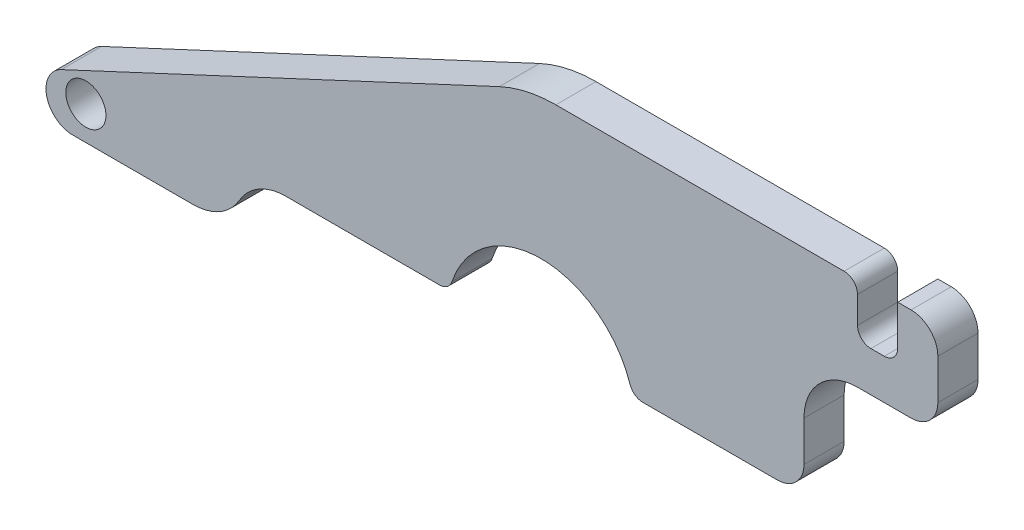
ISO-10303-21;
HEADER;
FILE_DESCRIPTION(('STEP AP214'),'2;1');
FILE_NAME('part.step','',(''),(''),'','','');
FILE_SCHEMA(('AUTOMOTIVE_DESIGN { 1 0 10303 214 1 1 1 1 }'));
ENDSEC;
DATA;
#1=APPLICATION_CONTEXT('core data for automotive mechanical design processes');
#2=APPLICATION_PROTOCOL_DEFINITION('international standard','automotive_design',2000,#1);
#3=PRODUCT_CONTEXT('',#1,'mechanical');
#4=PRODUCT('Part','Part','',(#3));
#5=PRODUCT_RELATED_PRODUCT_CATEGORY('part','',(#4));
#6=PRODUCT_DEFINITION_FORMATION('','',#4);
#7=PRODUCT_DEFINITION_CONTEXT('part definition',#1,'design');
#8=PRODUCT_DEFINITION('design','',#6,#7);
#9=PRODUCT_DEFINITION_SHAPE('','',#8);
#10=(LENGTH_UNIT() NAMED_UNIT(*) SI_UNIT(.MILLI.,.METRE.));
#11=(NAMED_UNIT(*) PLANE_ANGLE_UNIT() SI_UNIT($,.RADIAN.));
#12=(NAMED_UNIT(*) SI_UNIT($,.STERADIAN.) SOLID_ANGLE_UNIT());
#13=UNCERTAINTY_MEASURE_WITH_UNIT(LENGTH_MEASURE(1.E-05),#10,'distance_accuracy_value','');
#14=(GEOMETRIC_REPRESENTATION_CONTEXT(3) GLOBAL_UNCERTAINTY_ASSIGNED_CONTEXT((#13)) GLOBAL_UNIT_ASSIGNED_CONTEXT((#10,
#11,#12)) REPRESENTATION_CONTEXT('',''));
#15=CARTESIAN_POINT('',(0.,0.,0.));
#16=DIRECTION('',(0.,0.,1.));
#17=DIRECTION('',(1.,0.,0.));
#18=AXIS2_PLACEMENT_3D('',#15,#16,#17);
#19=CARTESIAN_POINT('',(5.82006920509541,12.5625,1.5));
#20=DIRECTION('',(0.,0.,-1.));
#21=DIRECTION('',(-1.,0.,0.));
#22=AXIS2_PLACEMENT_3D('',#19,#20,#21);
#23=PLANE('',#22);
#24=DIRECTION('',(-1.,0.,0.));
#25=VECTOR('',#24,1.);
#26=CARTESIAN_POINT('',(5.32006920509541,13.5625,1.5));
#27=LINE('',#26,#25);
#28=CARTESIAN_POINT('',(5.8200692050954,13.5625,1.5));
#29=VERTEX_POINT('',#28);
#30=CARTESIAN_POINT('',(5.32006920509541,13.5625,1.5));
#31=VERTEX_POINT('',#30);
#32=EDGE_CURVE('E290',#29,#31,#27,.T.);
#33=ORIENTED_EDGE('',*,*,#32,.T.);
#34=DIRECTION('',(0.,-1.,0.));
#35=VECTOR('',#34,1.);
#36=CARTESIAN_POINT('',(5.32006920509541,12.0625,1.5));
#37=LINE('',#36,#35);
#38=CARTESIAN_POINT('',(5.32006920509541,12.0625,1.5));
#39=VERTEX_POINT('',#38);
#40=EDGE_CURVE('E147',#31,#39,#37,.T.);
#41=ORIENTED_EDGE('',*,*,#40,.T.);
#42=CARTESIAN_POINT('',(4.82006920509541,12.0625,1.5));
#43=DIRECTION('',(0.,0.,-1.));
#44=DIRECTION('',(1.,0.,0.));
#45=AXIS2_PLACEMENT_3D('',#42,#43,#44);
#46=CIRCLE('',#45,0.5);
#47=CARTESIAN_POINT('',(4.8200692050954,11.5625,1.5));
#48=VERTEX_POINT('',#47);
#49=EDGE_CURVE('E359',#39,#48,#46,.T.);
#50=ORIENTED_EDGE('',*,*,#49,.T.);
#51=DIRECTION('',(-1.,0.,0.));
#52=VECTOR('',#51,1.);
#53=CARTESIAN_POINT('',(4.32006920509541,11.5625,1.5));
#54=LINE('',#53,#52);
#55=CARTESIAN_POINT('',(4.32006920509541,11.5625,1.5));
#56=VERTEX_POINT('',#55);
#57=EDGE_CURVE('E378',#48,#56,#54,.T.);
#58=ORIENTED_EDGE('',*,*,#57,.T.);
#59=CARTESIAN_POINT('',(4.32006920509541,12.0625,1.5));
#60=DIRECTION('',(0.,0.,-1.));
#61=DIRECTION('',(1.,0.,0.));
#62=AXIS2_PLACEMENT_3D('',#59,#60,#61);
#63=CIRCLE('',#62,0.5);
#64=CARTESIAN_POINT('',(3.82006920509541,12.0625,1.5));
#65=VERTEX_POINT('',#64);
#66=EDGE_CURVE('E375',#56,#65,#63,.T.);
#67=ORIENTED_EDGE('',*,*,#66,.T.);
#68=DIRECTION('',(0.,1.,0.));
#69=VECTOR('',#68,1.);
#70=CARTESIAN_POINT('',(3.82006920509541,13.0625,1.5));
#71=LINE('',#70,#69);
#72=CARTESIAN_POINT('',(3.82006920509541,13.0625,1.5));
#73=VERTEX_POINT('',#72);
#74=EDGE_CURVE('E377',#65,#73,#71,.T.);
#75=ORIENTED_EDGE('',*,*,#74,.T.);
#76=CARTESIAN_POINT('',(3.32006920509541,13.0625,1.5));
#77=DIRECTION('',(0.,0.,1.));
#78=DIRECTION('',(-1.,0.,0.));
#79=AXIS2_PLACEMENT_3D('',#76,#77,#78);
#80=CIRCLE('',#79,0.5);
#81=CARTESIAN_POINT('',(3.3200692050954,13.5625,1.5));
#82=VERTEX_POINT('',#81);
#83=EDGE_CURVE('E380',#73,#82,#80,.T.);
#84=ORIENTED_EDGE('',*,*,#83,.T.);
#85=DIRECTION('',(-1.,0.,0.));
#86=VECTOR('',#85,1.);
#87=CARTESIAN_POINT('',(-7.44645748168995,13.5625,1.5));
#88=LINE('',#87,#86);
#89=CARTESIAN_POINT('',(-7.44645748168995,13.5625,1.5));
#90=VERTEX_POINT('',#89);
#91=EDGE_CURVE('E386',#82,#90,#88,.T.);
#92=ORIENTED_EDGE('',*,*,#91,.T.);
#93=CARTESIAN_POINT('',(-7.44645748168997,8.56250000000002,1.5));
#94=DIRECTION('',(0.,0.,1.));
#95=DIRECTION('',(-1.,0.,0.));
#96=AXIS2_PLACEMENT_3D('',#93,#94,#95);
#97=CIRCLE('',#96,5.);
#98=CARTESIAN_POINT('',(-9.55954879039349,13.0940389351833,1.5));
#99=VERTEX_POINT('',#98);
#100=EDGE_CURVE('E388',#90,#99,#97,.T.);
#101=ORIENTED_EDGE('',*,*,#100,.T.);
#102=DIRECTION('',(-0.906307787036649,-0.422618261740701,0.));
#103=VECTOR('',#102,1.);
#104=CARTESIAN_POINT('',(-25.9119097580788,5.4688077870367,1.5));
#105=LINE('',#104,#103);
#106=CARTESIAN_POINT('',(-25.9119097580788,5.4688077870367,1.5));
#107=VERTEX_POINT('',#106);
#108=EDGE_CURVE('E390',#99,#107,#105,.T.);
#109=ORIENTED_EDGE('',*,*,#108,.T.);
#110=CARTESIAN_POINT('',(-25.4892914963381,4.56250000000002,1.5));
#111=DIRECTION('',(0.,0.,1.));
#112=DIRECTION('',(1.,0.,0.));
#113=AXIS2_PLACEMENT_3D('',#110,#111,#112);
#114=CIRCLE('',#113,1.);
#115=CARTESIAN_POINT('',(-25.4892914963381,3.56250000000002,1.5));
#116=VERTEX_POINT('',#115);
#117=EDGE_CURVE('E392',#107,#116,#114,.T.);
#118=ORIENTED_EDGE('',*,*,#117,.T.);
#119=DIRECTION('',(1.,0.,0.));
#120=VECTOR('',#119,1.);
#121=CARTESIAN_POINT('',(-25.4892914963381,3.56250000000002,1.5));
#122=LINE('',#121,#120);
#123=CARTESIAN_POINT('',(-21.0000000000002,3.56250000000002,1.5));
#124=VERTEX_POINT('',#123);
#125=EDGE_CURVE('E394',#116,#124,#122,.T.);
#126=ORIENTED_EDGE('',*,*,#125,.T.);
#127=CARTESIAN_POINT('',(-21.0000000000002,5.56250000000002,1.5));
#128=DIRECTION('',(0.,0.,1.));
#129=DIRECTION('',(1.,0.,0.));
#130=AXIS2_PLACEMENT_3D('',#127,#128,#129);
#131=CIRCLE('',#130,2.);
#132=CARTESIAN_POINT('',(-19.2679491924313,4.56250000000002,1.5));
#133=VERTEX_POINT('',#132);
#134=EDGE_CURVE('E396',#124,#133,#131,.T.);
#135=ORIENTED_EDGE('',*,*,#134,.T.);
#136=CARTESIAN_POINT('',(-17.5358983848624,3.56250000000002,1.5));
#137=DIRECTION('',(0.,0.,-1.));
#138=DIRECTION('',(1.,0.,0.));
#139=AXIS2_PLACEMENT_3D('',#136,#137,#138);
#140=CIRCLE('',#139,2.);
#141=CARTESIAN_POINT('',(-17.5358983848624,5.56250000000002,1.5));
#142=VERTEX_POINT('',#141);
#143=EDGE_CURVE('E398',#133,#142,#140,.T.);
#144=ORIENTED_EDGE('',*,*,#143,.T.);
#145=DIRECTION('',(1.,0.,0.));
#146=VECTOR('',#145,1.);
#147=CARTESIAN_POINT('',(-11.7996710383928,5.56250000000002,1.5));
#148=LINE('',#147,#146);
#149=CARTESIAN_POINT('',(-11.7996710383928,5.56250000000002,1.5));
#150=VERTEX_POINT('',#149);
#151=EDGE_CURVE('E400',#142,#150,#148,.T.);
#152=ORIENTED_EDGE('',*,*,#151,.T.);
#153=CARTESIAN_POINT('',(-11.7996710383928,6.06250000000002,1.5));
#154=DIRECTION('',(0.,0.,1.));
#155=DIRECTION('',(-1.,0.,0.));
#156=AXIS2_PLACEMENT_3D('',#153,#154,#155);
#157=CIRCLE('',#156,0.5);
#158=CARTESIAN_POINT('',(-11.3247121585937,5.90625000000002,1.5));
#159=VERTEX_POINT('',#158);
#160=EDGE_CURVE('E402',#150,#159,#157,.T.);
#161=ORIENTED_EDGE('',*,*,#160,.T.);
#162=CARTESIAN_POINT('',(-8.00000000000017,4.81250000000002,1.5));
#163=DIRECTION('',(0.,0.,-1.));
#164=DIRECTION('',(-1.,0.,0.));
#165=AXIS2_PLACEMENT_3D('',#162,#163,#164);
#166=CIRCLE('',#165,3.5);
#167=CARTESIAN_POINT('',(-4.67528784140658,5.90625000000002,1.5));
#168=VERTEX_POINT('',#167);
#169=EDGE_CURVE('E404',#159,#168,#166,.T.);
#170=ORIENTED_EDGE('',*,*,#169,.T.);
#171=CARTESIAN_POINT('',(-4.2003289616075,6.06250000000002,1.5));
#172=DIRECTION('',(0.,0.,1.));
#173=DIRECTION('',(-1.,0.,0.));
#174=AXIS2_PLACEMENT_3D('',#171,#172,#173);
#175=CIRCLE('',#174,0.499999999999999);
#176=CARTESIAN_POINT('',(-4.2003289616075,5.56250000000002,1.5));
#177=VERTEX_POINT('',#176);
#178=EDGE_CURVE('E406',#168,#177,#175,.T.);
#179=ORIENTED_EDGE('',*,*,#178,.T.);
#180=DIRECTION('',(1.,0.,0.));
#181=VECTOR('',#180,1.);
#182=CARTESIAN_POINT('',(0.820069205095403,5.56250000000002,1.5));
#183=LINE('',#182,#181);
#184=CARTESIAN_POINT('',(0.820069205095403,5.56250000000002,1.5));
#185=VERTEX_POINT('',#184);
#186=EDGE_CURVE('E408',#177,#185,#183,.T.);
#187=ORIENTED_EDGE('',*,*,#186,.T.);
#188=CARTESIAN_POINT('',(0.820069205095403,6.56250000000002,1.5));
#189=DIRECTION('',(0.,0.,1.));
#190=DIRECTION('',(-1.,0.,0.));
#191=AXIS2_PLACEMENT_3D('',#188,#189,#190);
#192=CIRCLE('',#191,1.);
#193=CARTESIAN_POINT('',(1.8200692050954,6.56250000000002,1.5));
#194=VERTEX_POINT('',#193);
#195=EDGE_CURVE('E410',#185,#194,#192,.T.);
#196=ORIENTED_EDGE('',*,*,#195,.T.);
#197=DIRECTION('',(0.,1.,0.));
#198=VECTOR('',#197,1.);
#199=CARTESIAN_POINT('',(1.82006920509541,8.0625,1.5));
#200=LINE('',#199,#198);
#201=CARTESIAN_POINT('',(1.82006920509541,8.0625,1.5));
#202=VERTEX_POINT('',#201);
#203=EDGE_CURVE('E412',#194,#202,#200,.T.);
#204=ORIENTED_EDGE('',*,*,#203,.T.);
#205=CARTESIAN_POINT('',(3.82006920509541,8.06250000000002,1.5));
#206=DIRECTION('',(0.,0.,-1.));
#207=DIRECTION('',(1.,0.,0.));
#208=AXIS2_PLACEMENT_3D('',#205,#206,#207);
#209=CIRCLE('',#208,2.);
#210=CARTESIAN_POINT('',(3.82006920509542,10.0625,1.5));
#211=VERTEX_POINT('',#210);
#212=EDGE_CURVE('E414',#202,#211,#209,.T.);
#213=ORIENTED_EDGE('',*,*,#212,.T.);
#214=DIRECTION('',(1.,0.,0.));
#215=VECTOR('',#214,1.);
#216=CARTESIAN_POINT('',(4.0075692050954,10.0625,1.5));
#217=LINE('',#216,#215);
#218=CARTESIAN_POINT('',(5.8200692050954,10.0625,1.5));
#219=VERTEX_POINT('',#218);
#220=EDGE_CURVE('E220',#211,#219,#217,.T.);
#221=ORIENTED_EDGE('',*,*,#220,.T.);
#222=CARTESIAN_POINT('',(5.82006920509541,11.0625,1.5));
#223=DIRECTION('',(0.,0.,1.));
#224=DIRECTION('',(-1.,0.,0.));
#225=AXIS2_PLACEMENT_3D('',#222,#223,#224);
#226=CIRCLE('',#225,1.);
#227=CARTESIAN_POINT('',(6.82006920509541,11.0625,1.5));
#228=VERTEX_POINT('',#227);
#229=EDGE_CURVE('E214',#219,#228,#226,.T.);
#230=ORIENTED_EDGE('',*,*,#229,.T.);
#231=DIRECTION('',(0.,1.,0.));
#232=VECTOR('',#231,1.);
#233=CARTESIAN_POINT('',(6.82006920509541,12.5625,1.5));
#234=LINE('',#233,#232);
#235=CARTESIAN_POINT('',(6.82006920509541,12.5625,1.5));
#236=VERTEX_POINT('',#235);
#237=EDGE_CURVE('E218',#228,#236,#234,.T.);
#238=ORIENTED_EDGE('',*,*,#237,.T.);
#239=CARTESIAN_POINT('',(5.82006920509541,12.5625,1.5));
#240=DIRECTION('',(0.,0.,1.));
#241=DIRECTION('',(-1.,0.,0.));
#242=AXIS2_PLACEMENT_3D('',#239,#240,#241);
#243=CIRCLE('',#242,1.);
#244=EDGE_CURVE('E50',#236,#29,#243,.T.);
#245=ORIENTED_EDGE('',*,*,#244,.T.);
#246=EDGE_LOOP('',(#33,#41,#50,#58,#67,#75,#84,#92,#101,#109,#118,#126,#135,#144,#152,#161,#170,
#179,#187,#196,#204,#213,#221,#230,#238,#245));
#247=FACE_BOUND('',#246,.T.);
#248=CARTESIAN_POINT('',(-25.0000000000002,4.81250000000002,1.5));
#249=DIRECTION('',(0.,0.,1.));
#250=DIRECTION('',(1.,0.,0.));
#251=AXIS2_PLACEMENT_3D('',#248,#249,#250);
#252=CIRCLE('',#251,0.750000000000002);
#253=CARTESIAN_POINT('',(-24.2500000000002,4.81250000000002,1.5));
#254=VERTEX_POINT('',#253);
#255=EDGE_CURVE('E242',#254,#254,#252,.T.);
#256=ORIENTED_EDGE('',*,*,#255,.F.);
#257=EDGE_LOOP('',(#256));
#258=FACE_BOUND('',#257,.T.);
#259=ADVANCED_FACE('F33',(#247,#258),#23,.F.);
#260=CARTESIAN_POINT('',(5.82006920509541,12.5625,0.));
#261=DIRECTION('',(0.,0.,-1.));
#262=DIRECTION('',(-1.,0.,0.));
#263=AXIS2_PLACEMENT_3D('',#260,#261,#262);
#264=PLANE('',#263);
#265=DIRECTION('',(-1.,0.,0.));
#266=VECTOR('',#265,1.);
#267=CARTESIAN_POINT('',(5.32006920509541,13.5625,0.));
#268=LINE('',#267,#266);
#269=CARTESIAN_POINT('',(5.8200692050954,13.5625,0.));
#270=VERTEX_POINT('',#269);
#271=CARTESIAN_POINT('',(5.32006920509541,13.5625,0.));
#272=VERTEX_POINT('',#271);
#273=EDGE_CURVE('E238',#270,#272,#268,.T.);
#274=ORIENTED_EDGE('',*,*,#273,.F.);
#275=CARTESIAN_POINT('',(5.82006920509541,12.5625,0.));
#276=DIRECTION('',(0.,0.,1.));
#277=DIRECTION('',(-1.,0.,0.));
#278=AXIS2_PLACEMENT_3D('',#275,#276,#277);
#279=CIRCLE('',#278,1.);
#280=CARTESIAN_POINT('',(6.82006920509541,12.5625,0.));
#281=VERTEX_POINT('',#280);
#282=EDGE_CURVE('E139',#281,#270,#279,.T.);
#283=ORIENTED_EDGE('',*,*,#282,.F.);
#284=DIRECTION('',(0.,1.,0.));
#285=VECTOR('',#284,1.);
#286=CARTESIAN_POINT('',(6.82006920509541,12.5625,0.));
#287=LINE('',#286,#285);
#288=CARTESIAN_POINT('',(6.82006920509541,11.0625,0.));
#289=VERTEX_POINT('',#288);
#290=EDGE_CURVE('E133',#289,#281,#287,.T.);
#291=ORIENTED_EDGE('',*,*,#290,.F.);
#292=CARTESIAN_POINT('',(5.82006920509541,11.0625,0.));
#293=DIRECTION('',(0.,0.,1.));
#294=DIRECTION('',(-1.,0.,0.));
#295=AXIS2_PLACEMENT_3D('',#292,#293,#294);
#296=CIRCLE('',#295,1.);
#297=CARTESIAN_POINT('',(5.8200692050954,10.0625,0.));
#298=VERTEX_POINT('',#297);
#299=EDGE_CURVE('E228',#298,#289,#296,.T.);
#300=ORIENTED_EDGE('',*,*,#299,.F.);
#301=DIRECTION('',(1.,0.,0.));
#302=VECTOR('',#301,1.);
#303=CARTESIAN_POINT('',(5.8200692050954,10.0625,0.));
#304=LINE('',#303,#302);
#305=CARTESIAN_POINT('',(3.82006920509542,10.0625,0.));
#306=VERTEX_POINT('',#305);
#307=EDGE_CURVE('E285',#306,#298,#304,.T.);
#308=ORIENTED_EDGE('',*,*,#307,.F.);
#309=CARTESIAN_POINT('',(3.82006920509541,8.06250000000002,0.));
#310=DIRECTION('',(0.,0.,-1.));
#311=DIRECTION('',(1.,0.,0.));
#312=AXIS2_PLACEMENT_3D('',#309,#310,#311);
#313=CIRCLE('',#312,2.);
#314=CARTESIAN_POINT('',(1.82006920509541,8.0625,0.));
#315=VERTEX_POINT('',#314);
#316=EDGE_CURVE('E282',#315,#306,#313,.T.);
#317=ORIENTED_EDGE('',*,*,#316,.F.);
#318=DIRECTION('',(0.,1.,0.));
#319=VECTOR('',#318,1.);
#320=CARTESIAN_POINT('',(1.82006920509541,8.0625,0.));
#321=LINE('',#320,#319);
#322=CARTESIAN_POINT('',(1.8200692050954,6.56250000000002,0.));
#323=VERTEX_POINT('',#322);
#324=EDGE_CURVE('E280',#323,#315,#321,.T.);
#325=ORIENTED_EDGE('',*,*,#324,.F.);
#326=CARTESIAN_POINT('',(0.820069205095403,6.56250000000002,0.));
#327=DIRECTION('',(0.,0.,1.));
#328=DIRECTION('',(-1.,0.,0.));
#329=AXIS2_PLACEMENT_3D('',#326,#327,#328);
#330=CIRCLE('',#329,1.);
#331=CARTESIAN_POINT('',(0.820069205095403,5.56250000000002,0.));
#332=VERTEX_POINT('',#331);
#333=EDGE_CURVE('E278',#332,#323,#330,.T.);
#334=ORIENTED_EDGE('',*,*,#333,.F.);
#335=DIRECTION('',(1.,0.,0.));
#336=VECTOR('',#335,1.);
#337=CARTESIAN_POINT('',(0.820069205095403,5.56250000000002,0.));
#338=LINE('',#337,#336);
#339=CARTESIAN_POINT('',(-4.2003289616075,5.56250000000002,0.));
#340=VERTEX_POINT('',#339);
#341=EDGE_CURVE('E276',#340,#332,#338,.T.);
#342=ORIENTED_EDGE('',*,*,#341,.F.);
#343=CARTESIAN_POINT('',(-4.2003289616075,6.06250000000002,0.));
#344=DIRECTION('',(0.,0.,1.));
#345=DIRECTION('',(-1.,0.,0.));
#346=AXIS2_PLACEMENT_3D('',#343,#344,#345);
#347=CIRCLE('',#346,0.499999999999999);
#348=CARTESIAN_POINT('',(-4.67528784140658,5.90625000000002,0.));
#349=VERTEX_POINT('',#348);
#350=EDGE_CURVE('E274',#349,#340,#347,.T.);
#351=ORIENTED_EDGE('',*,*,#350,.F.);
#352=CARTESIAN_POINT('',(-8.00000000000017,4.81250000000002,0.));
#353=DIRECTION('',(0.,0.,-1.));
#354=DIRECTION('',(-1.,0.,0.));
#355=AXIS2_PLACEMENT_3D('',#352,#353,#354);
#356=CIRCLE('',#355,3.5);
#357=CARTESIAN_POINT('',(-11.3247121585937,5.90625000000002,0.));
#358=VERTEX_POINT('',#357);
#359=EDGE_CURVE('E272',#358,#349,#356,.T.);
#360=ORIENTED_EDGE('',*,*,#359,.F.);
#361=CARTESIAN_POINT('',(-11.7996710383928,6.06250000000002,0.));
#362=DIRECTION('',(0.,0.,1.));
#363=DIRECTION('',(-1.,0.,0.));
#364=AXIS2_PLACEMENT_3D('',#361,#362,#363);
#365=CIRCLE('',#364,0.5);
#366=CARTESIAN_POINT('',(-11.7996710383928,5.56250000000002,0.));
#367=VERTEX_POINT('',#366);
#368=EDGE_CURVE('E270',#367,#358,#365,.T.);
#369=ORIENTED_EDGE('',*,*,#368,.F.);
#370=DIRECTION('',(1.,0.,0.));
#371=VECTOR('',#370,1.);
#372=CARTESIAN_POINT('',(-11.7996710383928,5.56250000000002,0.));
#373=LINE('',#372,#371);
#374=CARTESIAN_POINT('',(-17.5358983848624,5.56250000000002,0.));
#375=VERTEX_POINT('',#374);
#376=EDGE_CURVE('E268',#375,#367,#373,.T.);
#377=ORIENTED_EDGE('',*,*,#376,.F.);
#378=CARTESIAN_POINT('',(-17.5358983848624,3.56250000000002,0.));
#379=DIRECTION('',(0.,0.,-1.));
#380=DIRECTION('',(1.,0.,0.));
#381=AXIS2_PLACEMENT_3D('',#378,#379,#380);
#382=CIRCLE('',#381,2.);
#383=CARTESIAN_POINT('',(-19.2679491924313,4.56250000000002,0.));
#384=VERTEX_POINT('',#383);
#385=EDGE_CURVE('E266',#384,#375,#382,.T.);
#386=ORIENTED_EDGE('',*,*,#385,.F.);
#387=CARTESIAN_POINT('',(-21.0000000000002,5.56250000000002,0.));
#388=DIRECTION('',(0.,0.,1.));
#389=DIRECTION('',(1.,0.,0.));
#390=AXIS2_PLACEMENT_3D('',#387,#388,#389);
#391=CIRCLE('',#390,2.);
#392=CARTESIAN_POINT('',(-21.0000000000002,3.56250000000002,0.));
#393=VERTEX_POINT('',#392);
#394=EDGE_CURVE('E264',#393,#384,#391,.T.);
#395=ORIENTED_EDGE('',*,*,#394,.F.);
#396=DIRECTION('',(1.,0.,0.));
#397=VECTOR('',#396,1.);
#398=CARTESIAN_POINT('',(-25.4892914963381,3.56250000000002,0.));
#399=LINE('',#398,#397);
#400=CARTESIAN_POINT('',(-25.4892914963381,3.56250000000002,0.));
#401=VERTEX_POINT('',#400);
#402=EDGE_CURVE('E262',#401,#393,#399,.T.);
#403=ORIENTED_EDGE('',*,*,#402,.F.);
#404=CARTESIAN_POINT('',(-25.4892914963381,4.56250000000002,0.));
#405=DIRECTION('',(0.,0.,1.));
#406=DIRECTION('',(1.,0.,0.));
#407=AXIS2_PLACEMENT_3D('',#404,#405,#406);
#408=CIRCLE('',#407,1.);
#409=CARTESIAN_POINT('',(-25.9119097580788,5.4688077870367,0.));
#410=VERTEX_POINT('',#409);
#411=EDGE_CURVE('E260',#410,#401,#408,.T.);
#412=ORIENTED_EDGE('',*,*,#411,.F.);
#413=DIRECTION('',(-0.906307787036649,-0.422618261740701,0.));
#414=VECTOR('',#413,1.);
#415=CARTESIAN_POINT('',(-25.9119097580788,5.4688077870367,0.));
#416=LINE('',#415,#414);
#417=CARTESIAN_POINT('',(-9.55954879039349,13.0940389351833,0.));
#418=VERTEX_POINT('',#417);
#419=EDGE_CURVE('E258',#418,#410,#416,.T.);
#420=ORIENTED_EDGE('',*,*,#419,.F.);
#421=CARTESIAN_POINT('',(-7.44645748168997,8.56250000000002,0.));
#422=DIRECTION('',(0.,0.,1.));
#423=DIRECTION('',(-1.,0.,0.));
#424=AXIS2_PLACEMENT_3D('',#421,#422,#423);
#425=CIRCLE('',#424,5.);
#426=CARTESIAN_POINT('',(-7.44645748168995,13.5625,0.));
#427=VERTEX_POINT('',#426);
#428=EDGE_CURVE('E256',#427,#418,#425,.T.);
#429=ORIENTED_EDGE('',*,*,#428,.F.);
#430=DIRECTION('',(-1.,0.,0.));
#431=VECTOR('',#430,1.);
#432=CARTESIAN_POINT('',(-7.44645748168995,13.5625,0.));
#433=LINE('',#432,#431);
#434=CARTESIAN_POINT('',(3.3200692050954,13.5625,0.));
#435=VERTEX_POINT('',#434);
#436=EDGE_CURVE('E254',#435,#427,#433,.T.);
#437=ORIENTED_EDGE('',*,*,#436,.F.);
#438=CARTESIAN_POINT('',(3.32006920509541,13.0625,0.));
#439=DIRECTION('',(0.,0.,1.));
#440=DIRECTION('',(-1.,0.,0.));
#441=AXIS2_PLACEMENT_3D('',#438,#439,#440);
#442=CIRCLE('',#441,0.5);
#443=CARTESIAN_POINT('',(3.82006920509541,13.0625,0.));
#444=VERTEX_POINT('',#443);
#445=EDGE_CURVE('E252',#444,#435,#442,.T.);
#446=ORIENTED_EDGE('',*,*,#445,.F.);
#447=DIRECTION('',(0.,1.,0.));
#448=VECTOR('',#447,1.);
#449=CARTESIAN_POINT('',(3.82006920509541,13.0625,0.));
#450=LINE('',#449,#448);
#451=CARTESIAN_POINT('',(3.82006920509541,12.0625,0.));
#452=VERTEX_POINT('',#451);
#453=EDGE_CURVE('E250',#452,#444,#450,.T.);
#454=ORIENTED_EDGE('',*,*,#453,.F.);
#455=CARTESIAN_POINT('',(4.32006920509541,12.0625,0.));
#456=DIRECTION('',(0.,0.,-1.));
#457=DIRECTION('',(1.,0.,0.));
#458=AXIS2_PLACEMENT_3D('',#455,#456,#457);
#459=CIRCLE('',#458,0.5);
#460=CARTESIAN_POINT('',(4.32006920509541,11.5625,0.));
#461=VERTEX_POINT('',#460);
#462=EDGE_CURVE('E248',#461,#452,#459,.T.);
#463=ORIENTED_EDGE('',*,*,#462,.F.);
#464=DIRECTION('',(-1.,0.,0.));
#465=VECTOR('',#464,1.);
#466=CARTESIAN_POINT('',(4.32006920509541,11.5625,0.));
#467=LINE('',#466,#465);
#468=CARTESIAN_POINT('',(4.8200692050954,11.5625,0.));
#469=VERTEX_POINT('',#468);
#470=EDGE_CURVE('E246',#469,#461,#467,.T.);
#471=ORIENTED_EDGE('',*,*,#470,.F.);
#472=CARTESIAN_POINT('',(4.82006920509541,12.0625,0.));
#473=DIRECTION('',(0.,0.,-1.));
#474=DIRECTION('',(1.,0.,0.));
#475=AXIS2_PLACEMENT_3D('',#472,#473,#474);
#476=CIRCLE('',#475,0.5);
#477=CARTESIAN_POINT('',(5.32006920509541,12.0625,0.));
#478=VERTEX_POINT('',#477);
#479=EDGE_CURVE('E244',#478,#469,#476,.T.);
#480=ORIENTED_EDGE('',*,*,#479,.F.);
#481=DIRECTION('',(0.,-1.,0.));
#482=VECTOR('',#481,1.);
#483=CARTESIAN_POINT('',(5.32006920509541,12.0625,0.));
#484=LINE('',#483,#482);
#485=EDGE_CURVE('E241',#272,#478,#484,.T.);
#486=ORIENTED_EDGE('',*,*,#485,.F.);
#487=EDGE_LOOP('',(#274,#283,#291,#300,#308,#317,#325,#334,#342,#351,#360,#369,#377,#386,#395,
#403,#412,#420,#429,#437,#446,#454,#463,#471,#480,#486));
#488=FACE_BOUND('',#487,.T.);
#489=CARTESIAN_POINT('',(-25.0000000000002,4.81250000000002,0.));
#490=DIRECTION('',(0.,0.,1.));
#491=DIRECTION('',(1.,0.,0.));
#492=AXIS2_PLACEMENT_3D('',#489,#490,#491);
#493=CIRCLE('',#492,0.750000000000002);
#494=CARTESIAN_POINT('',(-24.2500000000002,4.81250000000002,0.));
#495=VERTEX_POINT('',#494);
#496=EDGE_CURVE('E745',#495,#495,#493,.T.);
#497=ORIENTED_EDGE('',*,*,#496,.T.);
#498=EDGE_LOOP('',(#497));
#499=FACE_BOUND('',#498,.T.);
#500=ADVANCED_FACE('F363',(#488,#499),#264,.T.);
#501=CARTESIAN_POINT('',(5.32006920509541,13.5625,1.5));
#502=DIRECTION('',(0.,-1.,0.));
#503=DIRECTION('',(0.,0.,-1.));
#504=AXIS2_PLACEMENT_3D('',#501,#502,#503);
#505=PLANE('',#504);
#506=ORIENTED_EDGE('',*,*,#273,.T.);
#507=DIRECTION('',(0.,0.,-1.));
#508=VECTOR('',#507,1.);
#509=CARTESIAN_POINT('',(5.32006920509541,13.5625,1.5));
#510=LINE('',#509,#508);
#511=EDGE_CURVE('E11',#31,#272,#510,.T.);
#512=ORIENTED_EDGE('',*,*,#511,.F.);
#513=ORIENTED_EDGE('',*,*,#32,.F.);
#514=DIRECTION('',(0.,0.,-1.));
#515=VECTOR('',#514,1.);
#516=CARTESIAN_POINT('',(5.8200692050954,13.5625,1.5));
#517=LINE('',#516,#515);
#518=EDGE_CURVE('E234',#29,#270,#517,.T.);
#519=ORIENTED_EDGE('',*,*,#518,.T.);
#520=EDGE_LOOP('',(#506,#512,#513,#519));
#521=FACE_BOUND('',#520,.T.);
#522=ADVANCED_FACE('F35',(#521),#505,.F.);
#523=CARTESIAN_POINT('',(5.32006920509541,12.0625,1.5));
#524=DIRECTION('',(1.,0.,0.));
#525=DIRECTION('',(0.,0.,-1.));
#526=AXIS2_PLACEMENT_3D('',#523,#524,#525);
#527=PLANE('',#526);
#528=ORIENTED_EDGE('',*,*,#485,.T.);
#529=DIRECTION('',(0.,0.,-1.));
#530=VECTOR('',#529,1.);
#531=CARTESIAN_POINT('',(5.32006920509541,12.0625,1.5));
#532=LINE('',#531,#530);
#533=EDGE_CURVE('E42',#39,#478,#532,.T.);
#534=ORIENTED_EDGE('',*,*,#533,.F.);
#535=ORIENTED_EDGE('',*,*,#40,.F.);
#536=ORIENTED_EDGE('',*,*,#511,.T.);
#537=EDGE_LOOP('',(#528,#534,#535,#536));
#538=FACE_BOUND('',#537,.T.);
#539=ADVANCED_FACE('F447',(#538),#527,.F.);
#540=CARTESIAN_POINT('',(4.82006920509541,12.0625,1.5));
#541=DIRECTION('',(0.,0.,-1.));
#542=DIRECTION('',(-1.,0.,0.));
#543=AXIS2_PLACEMENT_3D('',#540,#541,#542);
#544=CYLINDRICAL_SURFACE('',#543,0.5);
#545=ORIENTED_EDGE('',*,*,#479,.T.);
#546=DIRECTION('',(0.,0.,-1.));
#547=VECTOR('',#546,1.);
#548=CARTESIAN_POINT('',(4.8200692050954,11.5625,1.5));
#549=LINE('',#548,#547);
#550=EDGE_CURVE('E351',#48,#469,#549,.T.);
#551=ORIENTED_EDGE('',*,*,#550,.F.);
#552=ORIENTED_EDGE('',*,*,#49,.F.);
#553=ORIENTED_EDGE('',*,*,#533,.T.);
#554=EDGE_LOOP('',(#545,#551,#552,#553));
#555=FACE_BOUND('',#554,.T.);
#556=ADVANCED_FACE('F357',(#555),#544,.F.);
#557=CARTESIAN_POINT('',(4.32006920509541,11.5625,1.5));
#558=DIRECTION('',(0.,-1.,0.));
#559=DIRECTION('',(0.,0.,-1.));
#560=AXIS2_PLACEMENT_3D('',#557,#558,#559);
#561=PLANE('',#560);
#562=ORIENTED_EDGE('',*,*,#470,.T.);
#563=DIRECTION('',(0.,0.,-1.));
#564=VECTOR('',#563,1.);
#565=CARTESIAN_POINT('',(4.32006920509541,11.5625,1.5));
#566=LINE('',#565,#564);
#567=EDGE_CURVE('E348',#56,#461,#566,.T.);
#568=ORIENTED_EDGE('',*,*,#567,.F.);
#569=ORIENTED_EDGE('',*,*,#57,.F.);
#570=ORIENTED_EDGE('',*,*,#550,.T.);
#571=EDGE_LOOP('',(#562,#568,#569,#570));
#572=FACE_BOUND('',#571,.T.);
#573=ADVANCED_FACE('F369',(#572),#561,.F.);
#574=CARTESIAN_POINT('',(4.32006920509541,12.0625,1.5));
#575=DIRECTION('',(0.,0.,-1.));
#576=DIRECTION('',(-1.,0.,0.));
#577=AXIS2_PLACEMENT_3D('',#574,#575,#576);
#578=CYLINDRICAL_SURFACE('',#577,0.5);
#579=ORIENTED_EDGE('',*,*,#462,.T.);
#580=DIRECTION('',(0.,0.,-1.));
#581=VECTOR('',#580,1.);
#582=CARTESIAN_POINT('',(3.82006920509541,12.0625,1.5));
#583=LINE('',#582,#581);
#584=EDGE_CURVE('E345',#65,#452,#583,.T.);
#585=ORIENTED_EDGE('',*,*,#584,.F.);
#586=ORIENTED_EDGE('',*,*,#66,.F.);
#587=ORIENTED_EDGE('',*,*,#567,.T.);
#588=EDGE_LOOP('',(#579,#585,#586,#587));
#589=FACE_BOUND('',#588,.T.);
#590=ADVANCED_FACE('F373',(#589),#578,.F.);
#591=CARTESIAN_POINT('',(3.82006920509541,13.0625,1.5));
#592=DIRECTION('',(-1.,0.,0.));
#593=DIRECTION('',(0.,-1.,0.));
#594=AXIS2_PLACEMENT_3D('',#591,#592,#593);
#595=PLANE('',#594);
#596=ORIENTED_EDGE('',*,*,#453,.T.);
#597=DIRECTION('',(0.,0.,-1.));
#598=VECTOR('',#597,1.);
#599=CARTESIAN_POINT('',(3.82006920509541,13.0625,1.5));
#600=LINE('',#599,#598);
#601=EDGE_CURVE('E342',#73,#444,#600,.T.);
#602=ORIENTED_EDGE('',*,*,#601,.F.);
#603=ORIENTED_EDGE('',*,*,#74,.F.);
#604=ORIENTED_EDGE('',*,*,#584,.T.);
#605=EDGE_LOOP('',(#596,#602,#603,#604));
#606=FACE_BOUND('',#605,.T.);
#607=ADVANCED_FACE('F460',(#606),#595,.F.);
#608=CARTESIAN_POINT('',(3.32006920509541,13.0625,1.5));
#609=DIRECTION('',(0.,0.,-1.));
#610=DIRECTION('',(-1.,0.,0.));
#611=AXIS2_PLACEMENT_3D('',#608,#609,#610);
#612=CYLINDRICAL_SURFACE('',#611,0.5);
#613=ORIENTED_EDGE('',*,*,#445,.T.);
#614=DIRECTION('',(0.,0.,-1.));
#615=VECTOR('',#614,1.);
#616=CARTESIAN_POINT('',(3.3200692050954,13.5625,1.5));
#617=LINE('',#616,#615);
#618=EDGE_CURVE('E339',#82,#435,#617,.T.);
#619=ORIENTED_EDGE('',*,*,#618,.F.);
#620=ORIENTED_EDGE('',*,*,#83,.F.);
#621=ORIENTED_EDGE('',*,*,#601,.T.);
#622=EDGE_LOOP('',(#613,#619,#620,#621));
#623=FACE_BOUND('',#622,.T.);
#624=ADVANCED_FACE('F463',(#623),#612,.T.);
#625=CARTESIAN_POINT('',(-7.44645748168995,13.5625,1.5));
#626=DIRECTION('',(0.,-1.,0.));
#627=DIRECTION('',(0.,0.,-1.));
#628=AXIS2_PLACEMENT_3D('',#625,#626,#627);
#629=PLANE('',#628);
#630=ORIENTED_EDGE('',*,*,#436,.T.);
#631=DIRECTION('',(0.,0.,-1.));
#632=VECTOR('',#631,1.);
#633=CARTESIAN_POINT('',(-7.44645748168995,13.5625,1.5));
#634=LINE('',#633,#632);
#635=EDGE_CURVE('E336',#90,#427,#634,.T.);
#636=ORIENTED_EDGE('',*,*,#635,.F.);
#637=ORIENTED_EDGE('',*,*,#91,.F.);
#638=ORIENTED_EDGE('',*,*,#618,.T.);
#639=EDGE_LOOP('',(#630,#636,#637,#638));
#640=FACE_BOUND('',#639,.T.);
#641=ADVANCED_FACE('F467',(#640),#629,.F.);
#642=CARTESIAN_POINT('',(-7.44645748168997,8.56250000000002,1.5));
#643=DIRECTION('',(0.,0.,-1.));
#644=DIRECTION('',(-1.,0.,0.));
#645=AXIS2_PLACEMENT_3D('',#642,#643,#644);
#646=CYLINDRICAL_SURFACE('',#645,5.);
#647=ORIENTED_EDGE('',*,*,#428,.T.);
#648=DIRECTION('',(0.,0.,-1.));
#649=VECTOR('',#648,1.);
#650=CARTESIAN_POINT('',(-9.55954879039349,13.0940389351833,1.5));
#651=LINE('',#650,#649);
#652=EDGE_CURVE('E333',#99,#418,#651,.T.);
#653=ORIENTED_EDGE('',*,*,#652,.F.);
#654=ORIENTED_EDGE('',*,*,#100,.F.);
#655=ORIENTED_EDGE('',*,*,#635,.T.);
#656=EDGE_LOOP('',(#647,#653,#654,#655));
#657=FACE_BOUND('',#656,.T.);
#658=ADVANCED_FACE('F471',(#657),#646,.T.);
#659=CARTESIAN_POINT('',(-25.9119097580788,5.4688077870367,1.5));
#660=DIRECTION('',(0.422618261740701,-0.906307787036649,0.));
#661=DIRECTION('',(0.906307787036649,0.422618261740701,0.));
#662=AXIS2_PLACEMENT_3D('',#659,#660,#661);
#663=PLANE('',#662);
#664=ORIENTED_EDGE('',*,*,#419,.T.);
#665=DIRECTION('',(0.,0.,-1.));
#666=VECTOR('',#665,1.);
#667=CARTESIAN_POINT('',(-25.9119097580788,5.4688077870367,1.5));
#668=LINE('',#667,#666);
#669=EDGE_CURVE('E330',#107,#410,#668,.T.);
#670=ORIENTED_EDGE('',*,*,#669,.F.);
#671=ORIENTED_EDGE('',*,*,#108,.F.);
#672=ORIENTED_EDGE('',*,*,#652,.T.);
#673=EDGE_LOOP('',(#664,#670,#671,#672));
#674=FACE_BOUND('',#673,.T.);
#675=ADVANCED_FACE('F475',(#674),#663,.F.);
#676=CARTESIAN_POINT('',(-25.4892914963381,4.56250000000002,1.5));
#677=DIRECTION('',(0.,0.,-1.));
#678=DIRECTION('',(-1.,0.,0.));
#679=AXIS2_PLACEMENT_3D('',#676,#677,#678);
#680=CYLINDRICAL_SURFACE('',#679,1.);
#681=ORIENTED_EDGE('',*,*,#411,.T.);
#682=DIRECTION('',(0.,0.,-1.));
#683=VECTOR('',#682,1.);
#684=CARTESIAN_POINT('',(-25.4892914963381,3.56250000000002,1.5));
#685=LINE('',#684,#683);
#686=EDGE_CURVE('E327',#116,#401,#685,.T.);
#687=ORIENTED_EDGE('',*,*,#686,.F.);
#688=ORIENTED_EDGE('',*,*,#117,.F.);
#689=ORIENTED_EDGE('',*,*,#669,.T.);
#690=EDGE_LOOP('',(#681,#687,#688,#689));
#691=FACE_BOUND('',#690,.T.);
#692=ADVANCED_FACE('F479',(#691),#680,.T.);
#693=CARTESIAN_POINT('',(-25.4892914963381,3.56250000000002,1.5));
#694=DIRECTION('',(0.,1.,0.));
#695=DIRECTION('',(-1.,0.,0.));
#696=AXIS2_PLACEMENT_3D('',#693,#694,#695);
#697=PLANE('',#696);
#698=ORIENTED_EDGE('',*,*,#402,.T.);
#699=DIRECTION('',(0.,0.,-1.));
#700=VECTOR('',#699,1.);
#701=CARTESIAN_POINT('',(-21.0000000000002,3.56250000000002,1.5));
#702=LINE('',#701,#700);
#703=EDGE_CURVE('E324',#124,#393,#702,.T.);
#704=ORIENTED_EDGE('',*,*,#703,.F.);
#705=ORIENTED_EDGE('',*,*,#125,.F.);
#706=ORIENTED_EDGE('',*,*,#686,.T.);
#707=EDGE_LOOP('',(#698,#704,#705,#706));
#708=FACE_BOUND('',#707,.T.);
#709=ADVANCED_FACE('F483',(#708),#697,.F.);
#710=CARTESIAN_POINT('',(-21.0000000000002,5.56250000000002,1.5));
#711=DIRECTION('',(0.,0.,-1.));
#712=DIRECTION('',(-1.,0.,0.));
#713=AXIS2_PLACEMENT_3D('',#710,#711,#712);
#714=CYLINDRICAL_SURFACE('',#713,2.);
#715=ORIENTED_EDGE('',*,*,#394,.T.);
#716=DIRECTION('',(0.,0.,-1.));
#717=VECTOR('',#716,1.);
#718=CARTESIAN_POINT('',(-19.2679491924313,4.56250000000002,1.5));
#719=LINE('',#718,#717);
#720=EDGE_CURVE('E321',#133,#384,#719,.T.);
#721=ORIENTED_EDGE('',*,*,#720,.F.);
#722=ORIENTED_EDGE('',*,*,#134,.F.);
#723=ORIENTED_EDGE('',*,*,#703,.T.);
#724=EDGE_LOOP('',(#715,#721,#722,#723));
#725=FACE_BOUND('',#724,.T.);
#726=ADVANCED_FACE('F487',(#725),#714,.T.);
#727=CARTESIAN_POINT('',(-17.5358983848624,3.56250000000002,1.5));
#728=DIRECTION('',(0.,0.,-1.));
#729=DIRECTION('',(-1.,0.,0.));
#730=AXIS2_PLACEMENT_3D('',#727,#728,#729);
#731=CYLINDRICAL_SURFACE('',#730,2.);
#732=ORIENTED_EDGE('',*,*,#385,.T.);
#733=DIRECTION('',(0.,0.,-1.));
#734=VECTOR('',#733,1.);
#735=CARTESIAN_POINT('',(-17.5358983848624,5.56250000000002,1.5));
#736=LINE('',#735,#734);
#737=EDGE_CURVE('E318',#142,#375,#736,.T.);
#738=ORIENTED_EDGE('',*,*,#737,.F.);
#739=ORIENTED_EDGE('',*,*,#143,.F.);
#740=ORIENTED_EDGE('',*,*,#720,.T.);
#741=EDGE_LOOP('',(#732,#738,#739,#740));
#742=FACE_BOUND('',#741,.T.);
#743=ADVANCED_FACE('F491',(#742),#731,.F.);
#744=CARTESIAN_POINT('',(-11.7996710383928,5.56250000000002,1.5));
#745=DIRECTION('',(0.,1.,0.));
#746=DIRECTION('',(-1.,0.,0.));
#747=AXIS2_PLACEMENT_3D('',#744,#745,#746);
#748=PLANE('',#747);
#749=ORIENTED_EDGE('',*,*,#376,.T.);
#750=DIRECTION('',(0.,0.,-1.));
#751=VECTOR('',#750,1.);
#752=CARTESIAN_POINT('',(-11.7996710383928,5.56250000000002,1.5));
#753=LINE('',#752,#751);
#754=EDGE_CURVE('E315',#150,#367,#753,.T.);
#755=ORIENTED_EDGE('',*,*,#754,.F.);
#756=ORIENTED_EDGE('',*,*,#151,.F.);
#757=ORIENTED_EDGE('',*,*,#737,.T.);
#758=EDGE_LOOP('',(#749,#755,#756,#757));
#759=FACE_BOUND('',#758,.T.);
#760=ADVANCED_FACE('F495',(#759),#748,.F.);
#761=CARTESIAN_POINT('',(-11.7996710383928,6.06250000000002,1.5));
#762=DIRECTION('',(0.,0.,-1.));
#763=DIRECTION('',(-1.,0.,0.));
#764=AXIS2_PLACEMENT_3D('',#761,#762,#763);
#765=CYLINDRICAL_SURFACE('',#764,0.5);
#766=ORIENTED_EDGE('',*,*,#368,.T.);
#767=DIRECTION('',(0.,0.,-1.));
#768=VECTOR('',#767,1.);
#769=CARTESIAN_POINT('',(-11.3247121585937,5.90625000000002,1.5));
#770=LINE('',#769,#768);
#771=EDGE_CURVE('E312',#159,#358,#770,.T.);
#772=ORIENTED_EDGE('',*,*,#771,.F.);
#773=ORIENTED_EDGE('',*,*,#160,.F.);
#774=ORIENTED_EDGE('',*,*,#754,.T.);
#775=EDGE_LOOP('',(#766,#772,#773,#774));
#776=FACE_BOUND('',#775,.T.);
#777=ADVANCED_FACE('F499',(#776),#765,.T.);
#778=CARTESIAN_POINT('',(-8.00000000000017,4.81250000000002,1.5));
#779=DIRECTION('',(0.,0.,-1.));
#780=DIRECTION('',(-1.,0.,0.));
#781=AXIS2_PLACEMENT_3D('',#778,#779,#780);
#782=CYLINDRICAL_SURFACE('',#781,3.5);
#783=ORIENTED_EDGE('',*,*,#359,.T.);
#784=DIRECTION('',(0.,0.,-1.));
#785=VECTOR('',#784,1.);
#786=CARTESIAN_POINT('',(-4.67528784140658,5.90625000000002,1.5));
#787=LINE('',#786,#785);
#788=EDGE_CURVE('E309',#168,#349,#787,.T.);
#789=ORIENTED_EDGE('',*,*,#788,.F.);
#790=ORIENTED_EDGE('',*,*,#169,.F.);
#791=ORIENTED_EDGE('',*,*,#771,.T.);
#792=EDGE_LOOP('',(#783,#789,#790,#791));
#793=FACE_BOUND('',#792,.T.);
#794=ADVANCED_FACE('F503',(#793),#782,.F.);
#795=CARTESIAN_POINT('',(-4.2003289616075,6.06250000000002,1.5));
#796=DIRECTION('',(0.,0.,-1.));
#797=DIRECTION('',(-1.,0.,0.));
#798=AXIS2_PLACEMENT_3D('',#795,#796,#797);
#799=CYLINDRICAL_SURFACE('',#798,0.499999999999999);
#800=ORIENTED_EDGE('',*,*,#350,.T.);
#801=DIRECTION('',(0.,0.,-1.));
#802=VECTOR('',#801,1.);
#803=CARTESIAN_POINT('',(-4.2003289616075,5.56250000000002,1.5));
#804=LINE('',#803,#802);
#805=EDGE_CURVE('E306',#177,#340,#804,.T.);
#806=ORIENTED_EDGE('',*,*,#805,.F.);
#807=ORIENTED_EDGE('',*,*,#178,.F.);
#808=ORIENTED_EDGE('',*,*,#788,.T.);
#809=EDGE_LOOP('',(#800,#806,#807,#808));
#810=FACE_BOUND('',#809,.T.);
#811=ADVANCED_FACE('F507',(#810),#799,.T.);
#812=CARTESIAN_POINT('',(0.820069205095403,5.56250000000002,1.5));
#813=DIRECTION('',(0.,1.,0.));
#814=DIRECTION('',(0.,0.,1.));
#815=AXIS2_PLACEMENT_3D('',#812,#813,#814);
#816=PLANE('',#815);
#817=ORIENTED_EDGE('',*,*,#341,.T.);
#818=DIRECTION('',(0.,0.,-1.));
#819=VECTOR('',#818,1.);
#820=CARTESIAN_POINT('',(0.820069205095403,5.56250000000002,1.5));
#821=LINE('',#820,#819);
#822=EDGE_CURVE('E303',#185,#332,#821,.T.);
#823=ORIENTED_EDGE('',*,*,#822,.F.);
#824=ORIENTED_EDGE('',*,*,#186,.F.);
#825=ORIENTED_EDGE('',*,*,#805,.T.);
#826=EDGE_LOOP('',(#817,#823,#824,#825));
#827=FACE_BOUND('',#826,.T.);
#828=ADVANCED_FACE('F511',(#827),#816,.F.);
#829=CARTESIAN_POINT('',(0.820069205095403,6.56250000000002,1.5));
#830=DIRECTION('',(0.,0.,-1.));
#831=DIRECTION('',(-1.,0.,0.));
#832=AXIS2_PLACEMENT_3D('',#829,#830,#831);
#833=CYLINDRICAL_SURFACE('',#832,1.);
#834=ORIENTED_EDGE('',*,*,#333,.T.);
#835=DIRECTION('',(0.,0.,-1.));
#836=VECTOR('',#835,1.);
#837=CARTESIAN_POINT('',(1.8200692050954,6.56250000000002,1.5));
#838=LINE('',#837,#836);
#839=EDGE_CURVE('E300',#194,#323,#838,.T.);
#840=ORIENTED_EDGE('',*,*,#839,.F.);
#841=ORIENTED_EDGE('',*,*,#195,.F.);
#842=ORIENTED_EDGE('',*,*,#822,.T.);
#843=EDGE_LOOP('',(#834,#840,#841,#842));
#844=FACE_BOUND('',#843,.T.);
#845=ADVANCED_FACE('F515',(#844),#833,.T.);
#846=CARTESIAN_POINT('',(1.82006920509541,8.0625,1.5));
#847=DIRECTION('',(-1.,0.,0.));
#848=DIRECTION('',(0.,-1.,0.));
#849=AXIS2_PLACEMENT_3D('',#846,#847,#848);
#850=PLANE('',#849);
#851=ORIENTED_EDGE('',*,*,#324,.T.);
#852=DIRECTION('',(0.,0.,-1.));
#853=VECTOR('',#852,1.);
#854=CARTESIAN_POINT('',(1.82006920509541,8.0625,1.5));
#855=LINE('',#854,#853);
#856=EDGE_CURVE('E297',#202,#315,#855,.T.);
#857=ORIENTED_EDGE('',*,*,#856,.F.);
#858=ORIENTED_EDGE('',*,*,#203,.F.);
#859=ORIENTED_EDGE('',*,*,#839,.T.);
#860=EDGE_LOOP('',(#851,#857,#858,#859));
#861=FACE_BOUND('',#860,.T.);
#862=ADVANCED_FACE('F519',(#861),#850,.F.);
#863=CARTESIAN_POINT('',(3.82006920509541,8.06250000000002,1.5));
#864=DIRECTION('',(0.,0.,-1.));
#865=DIRECTION('',(-1.,0.,0.));
#866=AXIS2_PLACEMENT_3D('',#863,#864,#865);
#867=CYLINDRICAL_SURFACE('',#866,2.);
#868=ORIENTED_EDGE('',*,*,#316,.T.);
#869=DIRECTION('',(0.,0.,-1.));
#870=VECTOR('',#869,1.);
#871=CARTESIAN_POINT('',(3.82006920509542,10.0625,1.5));
#872=LINE('',#871,#870);
#873=EDGE_CURVE('E294',#211,#306,#872,.T.);
#874=ORIENTED_EDGE('',*,*,#873,.F.);
#875=ORIENTED_EDGE('',*,*,#212,.F.);
#876=ORIENTED_EDGE('',*,*,#856,.T.);
#877=EDGE_LOOP('',(#868,#874,#875,#876));
#878=FACE_BOUND('',#877,.T.);
#879=ADVANCED_FACE('F420',(#878),#867,.F.);
#880=CARTESIAN_POINT('',(5.8200692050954,10.0625,1.5));
#881=DIRECTION('',(0.,1.,0.));
#882=DIRECTION('',(-1.,0.,0.));
#883=AXIS2_PLACEMENT_3D('',#880,#881,#882);
#884=PLANE('',#883);
#885=ORIENTED_EDGE('',*,*,#307,.T.);
#886=DIRECTION('',(0.,0.,-1.));
#887=VECTOR('',#886,1.);
#888=CARTESIAN_POINT('',(5.8200692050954,10.0625,1.5));
#889=LINE('',#888,#887);
#890=EDGE_CURVE('E229',#219,#298,#889,.T.);
#891=ORIENTED_EDGE('',*,*,#890,.F.);
#892=ORIENTED_EDGE('',*,*,#220,.F.);
#893=ORIENTED_EDGE('',*,*,#873,.T.);
#894=EDGE_LOOP('',(#885,#891,#892,#893));
#895=FACE_BOUND('',#894,.T.);
#896=ADVANCED_FACE('F423',(#895),#884,.F.);
#897=CARTESIAN_POINT('',(5.82006920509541,11.0625,1.5));
#898=DIRECTION('',(0.,0.,-1.));
#899=DIRECTION('',(-1.,0.,0.));
#900=AXIS2_PLACEMENT_3D('',#897,#898,#899);
#901=CYLINDRICAL_SURFACE('',#900,1.);
#902=ORIENTED_EDGE('',*,*,#299,.T.);
#903=DIRECTION('',(0.,0.,-1.));
#904=VECTOR('',#903,1.);
#905=CARTESIAN_POINT('',(6.82006920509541,11.0625,1.5));
#906=LINE('',#905,#904);
#907=EDGE_CURVE('E225',#228,#289,#906,.T.);
#908=ORIENTED_EDGE('',*,*,#907,.F.);
#909=ORIENTED_EDGE('',*,*,#229,.F.);
#910=ORIENTED_EDGE('',*,*,#890,.T.);
#911=EDGE_LOOP('',(#902,#908,#909,#910));
#912=FACE_BOUND('',#911,.T.);
#913=ADVANCED_FACE('F226',(#912),#901,.T.);
#914=CARTESIAN_POINT('',(6.82006920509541,12.5625,1.5));
#915=DIRECTION('',(-1.,0.,0.));
#916=DIRECTION('',(0.,-1.,0.));
#917=AXIS2_PLACEMENT_3D('',#914,#915,#916);
#918=PLANE('',#917);
#919=ORIENTED_EDGE('',*,*,#290,.T.);
#920=DIRECTION('',(0.,0.,-1.));
#921=VECTOR('',#920,1.);
#922=CARTESIAN_POINT('',(6.82006920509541,12.5625,1.5));
#923=LINE('',#922,#921);
#924=EDGE_CURVE('E230',#236,#281,#923,.T.);
#925=ORIENTED_EDGE('',*,*,#924,.F.);
#926=ORIENTED_EDGE('',*,*,#237,.F.);
#927=ORIENTED_EDGE('',*,*,#907,.T.);
#928=EDGE_LOOP('',(#919,#925,#926,#927));
#929=FACE_BOUND('',#928,.T.);
#930=ADVANCED_FACE('F232',(#929),#918,.F.);
#931=CARTESIAN_POINT('',(5.82006920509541,12.5625,1.5));
#932=DIRECTION('',(0.,0.,-1.));
#933=DIRECTION('',(-1.,0.,0.));
#934=AXIS2_PLACEMENT_3D('',#931,#932,#933);
#935=CYLINDRICAL_SURFACE('',#934,1.);
#936=ORIENTED_EDGE('',*,*,#282,.T.);
#937=ORIENTED_EDGE('',*,*,#518,.F.);
#938=ORIENTED_EDGE('',*,*,#244,.F.);
#939=ORIENTED_EDGE('',*,*,#924,.T.);
#940=EDGE_LOOP('',(#936,#937,#938,#939));
#941=FACE_BOUND('',#940,.T.);
#942=ADVANCED_FACE('F427',(#941),#935,.T.);
#943=CARTESIAN_POINT('',(-25.0000000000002,4.81250000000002,1.5));
#944=DIRECTION('',(0.,0.,-1.));
#945=DIRECTION('',(-1.,0.,0.));
#946=AXIS2_PLACEMENT_3D('',#943,#944,#945);
#947=CYLINDRICAL_SURFACE('',#946,0.750000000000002);
#948=ORIENTED_EDGE('',*,*,#255,.T.);
#949=EDGE_LOOP('',(#948));
#950=FACE_BOUND('',#949,.T.);
#951=ORIENTED_EDGE('',*,*,#496,.F.);
#952=EDGE_LOOP('',(#951));
#953=FACE_BOUND('',#952,.T.);
#954=ADVANCED_FACE('F429',(#950,#953),#947,.F.);
#955=CLOSED_SHELL('',(#259,#500,#522,#539,#556,#573,#590,#607,#624,#641,#658,#675,#692,#709,
#726,#743,#760,#777,#794,#811,#828,#845,#862,#879,#896,#913,#930,#942,#954));
#956=MANIFOLD_SOLID_BREP('B2',#955);
#957=ADVANCED_BREP_SHAPE_REPRESENTATION('',(#18,#956),#14);
#958=SHAPE_DEFINITION_REPRESENTATION(#9,#957);
ENDSEC;
END-ISO-10303-21;
